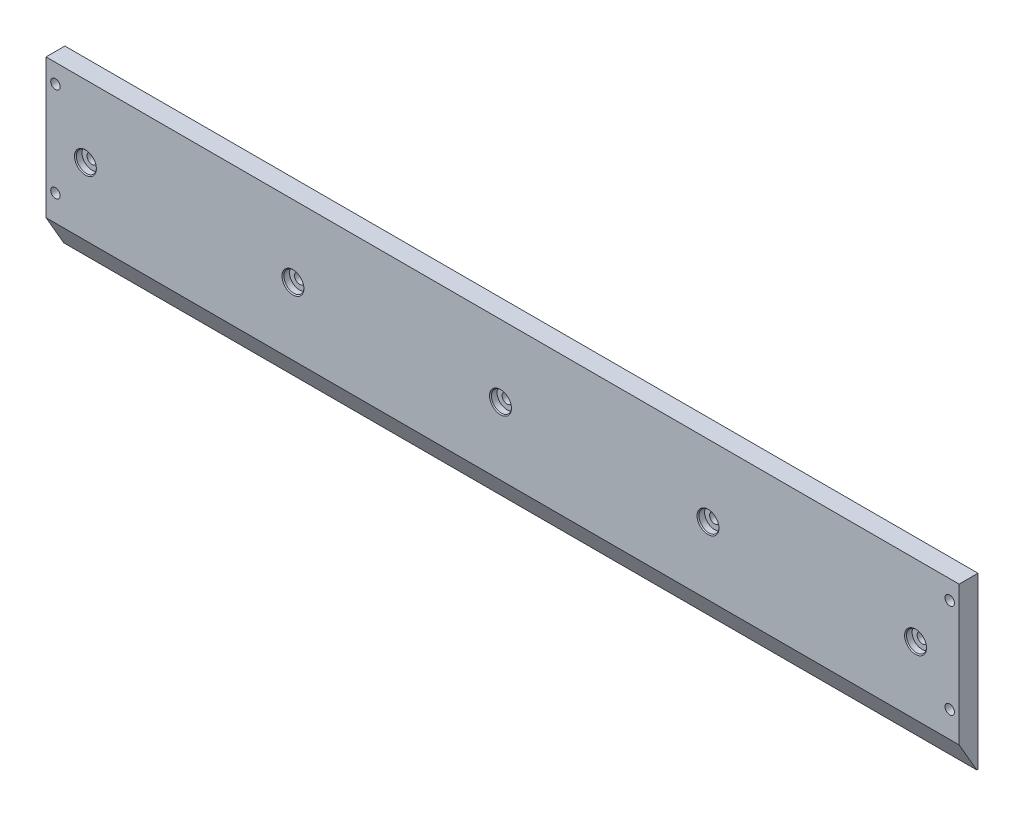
ISO-10303-21;
HEADER;
FILE_DESCRIPTION(('STEP AP214'),'2;1');
FILE_NAME('part.step','',(''),(''),'','','');
FILE_SCHEMA(('AUTOMOTIVE_DESIGN { 1 0 10303 214 1 1 1 1 }'));
ENDSEC;
DATA;
#1=APPLICATION_CONTEXT('core data for automotive mechanical design processes');
#2=APPLICATION_PROTOCOL_DEFINITION('international standard','automotive_design',2000,#1);
#3=PRODUCT_CONTEXT('',#1,'mechanical');
#4=PRODUCT('Part','Part','',(#3));
#5=PRODUCT_RELATED_PRODUCT_CATEGORY('part','',(#4));
#6=PRODUCT_DEFINITION_FORMATION('','',#4);
#7=PRODUCT_DEFINITION_CONTEXT('part definition',#1,'design');
#8=PRODUCT_DEFINITION('design','',#6,#7);
#9=PRODUCT_DEFINITION_SHAPE('','',#8);
#10=(LENGTH_UNIT() NAMED_UNIT(*) SI_UNIT(.MILLI.,.METRE.));
#11=(NAMED_UNIT(*) PLANE_ANGLE_UNIT() SI_UNIT($,.RADIAN.));
#12=(NAMED_UNIT(*) SI_UNIT($,.STERADIAN.) SOLID_ANGLE_UNIT());
#13=UNCERTAINTY_MEASURE_WITH_UNIT(LENGTH_MEASURE(1.E-05),#10,'distance_accuracy_value','');
#14=(GEOMETRIC_REPRESENTATION_CONTEXT(3) GLOBAL_UNCERTAINTY_ASSIGNED_CONTEXT((#13)) GLOBAL_UNIT_ASSIGNED_CONTEXT((#10,
#11,#12)) REPRESENTATION_CONTEXT('',''));
#15=CARTESIAN_POINT('',(0.,0.,0.));
#16=DIRECTION('',(0.,0.,1.));
#17=DIRECTION('',(1.,0.,0.));
#18=AXIS2_PLACEMENT_3D('',#15,#16,#17);
#19=CARTESIAN_POINT('',(278.003,66.04,12.7000000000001));
#20=DIRECTION('',(0.,0.,1.));
#21=DIRECTION('',(1.,0.,0.));
#22=AXIS2_PLACEMENT_3D('',#19,#20,#21);
#23=CONICAL_SURFACE('',#22,7.38124000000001,0.785398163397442);
#24=CARTESIAN_POINT('',(278.003,66.04,12.0650000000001));
#25=DIRECTION('',(0.,0.,1.));
#26=DIRECTION('',(1.,0.,0.));
#27=AXIS2_PLACEMENT_3D('',#24,#25,#26);
#28=CIRCLE('',#27,6.74624000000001);
#29=CARTESIAN_POINT('',(284.74924,66.04,12.0650000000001));
#30=VERTEX_POINT('',#29);
#31=EDGE_CURVE('E11',#30,#30,#28,.T.);
#32=ORIENTED_EDGE('',*,*,#31,.F.);
#33=EDGE_LOOP('',(#32));
#34=FACE_BOUND('',#33,.T.);
#35=CARTESIAN_POINT('',(278.003,66.04,12.7000000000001));
#36=DIRECTION('',(0.,0.,1.));
#37=DIRECTION('',(1.,0.,0.));
#38=AXIS2_PLACEMENT_3D('',#35,#36,#37);
#39=CIRCLE('',#38,7.38124000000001);
#40=CARTESIAN_POINT('',(285.38424,66.04,12.7000000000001));
#41=VERTEX_POINT('',#40);
#42=EDGE_CURVE('E156',#41,#41,#39,.T.);
#43=ORIENTED_EDGE('',*,*,#42,.T.);
#44=EDGE_LOOP('',(#43));
#45=FACE_BOUND('',#44,.T.);
#46=ADVANCED_FACE('F34',(#34,#45),#23,.F.);
#47=CARTESIAN_POINT('',(278.003,66.04,12.7000000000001));
#48=DIRECTION('',(0.,0.,1.));
#49=DIRECTION('',(1.,0.,0.));
#50=AXIS2_PLACEMENT_3D('',#47,#48,#49);
#51=CYLINDRICAL_SURFACE('',#50,6.74624000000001);
#52=CARTESIAN_POINT('',(278.003,66.04,8.25500000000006));
#53=DIRECTION('',(0.,0.,1.));
#54=DIRECTION('',(1.,0.,0.));
#55=AXIS2_PLACEMENT_3D('',#52,#53,#54);
#56=CIRCLE('',#55,6.74624000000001);
#57=CARTESIAN_POINT('',(284.74924,66.04,8.25500000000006));
#58=VERTEX_POINT('',#57);
#59=EDGE_CURVE('E42',#58,#58,#56,.T.);
#60=ORIENTED_EDGE('',*,*,#59,.F.);
#61=EDGE_LOOP('',(#60));
#62=FACE_BOUND('',#61,.T.);
#63=ORIENTED_EDGE('',*,*,#31,.T.);
#64=EDGE_LOOP('',(#63));
#65=FACE_BOUND('',#64,.T.);
#66=ADVANCED_FACE('F169',(#62,#65),#51,.F.);
#67=CARTESIAN_POINT('',(284.74924,66.04,8.25500000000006));
#68=DIRECTION('',(0.,0.,-1.));
#69=DIRECTION('',(-1.,0.,0.));
#70=AXIS2_PLACEMENT_3D('',#67,#68,#69);
#71=PLANE('',#70);
#72=CARTESIAN_POINT('',(278.003,66.04,8.25500000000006));
#73=DIRECTION('',(0.,0.,1.));
#74=DIRECTION('',(1.,0.,0.));
#75=AXIS2_PLACEMENT_3D('',#72,#73,#74);
#76=CIRCLE('',#75,3.3782);
#77=CARTESIAN_POINT('',(281.3812,66.04,8.25500000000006));
#78=VERTEX_POINT('',#77);
#79=EDGE_CURVE('E162',#78,#78,#76,.T.);
#80=ORIENTED_EDGE('',*,*,#79,.F.);
#81=EDGE_LOOP('',(#80));
#82=FACE_BOUND('',#81,.T.);
#83=ORIENTED_EDGE('',*,*,#59,.T.);
#84=EDGE_LOOP('',(#83));
#85=FACE_BOUND('',#84,.T.);
#86=ADVANCED_FACE('F167',(#82,#85),#71,.F.);
#87=CARTESIAN_POINT('',(278.003,66.04,12.7000000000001));
#88=DIRECTION('',(0.,0.,1.));
#89=DIRECTION('',(1.,0.,0.));
#90=AXIS2_PLACEMENT_3D('',#87,#88,#89);
#91=CYLINDRICAL_SURFACE('',#90,3.3782);
#92=CARTESIAN_POINT('',(278.003,66.04,0.));
#93=DIRECTION('',(0.,0.,1.));
#94=DIRECTION('',(1.,0.,0.));
#95=AXIS2_PLACEMENT_3D('',#92,#93,#94);
#96=CIRCLE('',#95,3.3782);
#97=CARTESIAN_POINT('',(281.3812,66.04,0.));
#98=VERTEX_POINT('',#97);
#99=EDGE_CURVE('E159',#98,#98,#96,.T.);
#100=ORIENTED_EDGE('',*,*,#99,.F.);
#101=EDGE_LOOP('',(#100));
#102=FACE_BOUND('',#101,.T.);
#103=ORIENTED_EDGE('',*,*,#79,.T.);
#104=EDGE_LOOP('',(#103));
#105=FACE_BOUND('',#104,.T.);
#106=ADVANCED_FACE('F228',(#102,#105),#91,.F.);
#107=CARTESIAN_POINT('',(138.303,66.04,12.7000000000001));
#108=DIRECTION('',(0.,0.,1.));
#109=DIRECTION('',(1.,0.,0.));
#110=AXIS2_PLACEMENT_3D('',#107,#108,#109);
#111=CONICAL_SURFACE('',#110,7.38124000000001,0.785398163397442);
#112=CARTESIAN_POINT('',(138.303,66.04,12.0650000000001));
#113=DIRECTION('',(0.,0.,1.));
#114=DIRECTION('',(1.,0.,0.));
#115=AXIS2_PLACEMENT_3D('',#112,#113,#114);
#116=CIRCLE('',#115,6.74624000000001);
#117=CARTESIAN_POINT('',(145.04924,66.04,12.0650000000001));
#118=VERTEX_POINT('',#117);
#119=EDGE_CURVE('E153',#118,#118,#116,.T.);
#120=ORIENTED_EDGE('',*,*,#119,.F.);
#121=EDGE_LOOP('',(#120));
#122=FACE_BOUND('',#121,.T.);
#123=CARTESIAN_POINT('',(138.303,66.04,12.7000000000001));
#124=DIRECTION('',(0.,0.,1.));
#125=DIRECTION('',(1.,0.,0.));
#126=AXIS2_PLACEMENT_3D('',#123,#124,#125);
#127=CIRCLE('',#126,7.38124000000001);
#128=CARTESIAN_POINT('',(145.68424,66.04,12.7000000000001));
#129=VERTEX_POINT('',#128);
#130=EDGE_CURVE('E141',#129,#129,#127,.T.);
#131=ORIENTED_EDGE('',*,*,#130,.T.);
#132=EDGE_LOOP('',(#131));
#133=FACE_BOUND('',#132,.T.);
#134=ADVANCED_FACE('F224',(#122,#133),#111,.F.);
#135=CARTESIAN_POINT('',(138.303,66.04,12.7000000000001));
#136=DIRECTION('',(0.,0.,1.));
#137=DIRECTION('',(1.,0.,0.));
#138=AXIS2_PLACEMENT_3D('',#135,#136,#137);
#139=CYLINDRICAL_SURFACE('',#138,6.74624000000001);
#140=CARTESIAN_POINT('',(138.303,66.04,8.25500000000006));
#141=DIRECTION('',(0.,0.,1.));
#142=DIRECTION('',(1.,0.,0.));
#143=AXIS2_PLACEMENT_3D('',#140,#141,#142);
#144=CIRCLE('',#143,6.74624000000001);
#145=CARTESIAN_POINT('',(145.04924,66.04,8.25500000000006));
#146=VERTEX_POINT('',#145);
#147=EDGE_CURVE('E150',#146,#146,#144,.T.);
#148=ORIENTED_EDGE('',*,*,#147,.F.);
#149=EDGE_LOOP('',(#148));
#150=FACE_BOUND('',#149,.T.);
#151=ORIENTED_EDGE('',*,*,#119,.T.);
#152=EDGE_LOOP('',(#151));
#153=FACE_BOUND('',#152,.T.);
#154=ADVANCED_FACE('F220',(#150,#153),#139,.F.);
#155=CARTESIAN_POINT('',(145.04924,66.04,8.25500000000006));
#156=DIRECTION('',(0.,0.,-1.));
#157=DIRECTION('',(-1.,0.,0.));
#158=AXIS2_PLACEMENT_3D('',#155,#156,#157);
#159=PLANE('',#158);
#160=CARTESIAN_POINT('',(138.303,66.04,8.25500000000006));
#161=DIRECTION('',(0.,0.,1.));
#162=DIRECTION('',(1.,0.,0.));
#163=AXIS2_PLACEMENT_3D('',#160,#161,#162);
#164=CIRCLE('',#163,3.3782);
#165=CARTESIAN_POINT('',(141.6812,66.04,8.25500000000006));
#166=VERTEX_POINT('',#165);
#167=EDGE_CURVE('E147',#166,#166,#164,.T.);
#168=ORIENTED_EDGE('',*,*,#167,.F.);
#169=EDGE_LOOP('',(#168));
#170=FACE_BOUND('',#169,.T.);
#171=ORIENTED_EDGE('',*,*,#147,.T.);
#172=EDGE_LOOP('',(#171));
#173=FACE_BOUND('',#172,.T.);
#174=ADVANCED_FACE('F216',(#170,#173),#159,.F.);
#175=CARTESIAN_POINT('',(138.303,66.04,12.7000000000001));
#176=DIRECTION('',(0.,0.,1.));
#177=DIRECTION('',(1.,0.,0.));
#178=AXIS2_PLACEMENT_3D('',#175,#176,#177);
#179=CYLINDRICAL_SURFACE('',#178,3.3782);
#180=CARTESIAN_POINT('',(138.303,66.04,0.));
#181=DIRECTION('',(0.,0.,1.));
#182=DIRECTION('',(1.,0.,0.));
#183=AXIS2_PLACEMENT_3D('',#180,#181,#182);
#184=CIRCLE('',#183,3.3782);
#185=CARTESIAN_POINT('',(141.6812,66.04,0.));
#186=VERTEX_POINT('',#185);
#187=EDGE_CURVE('E144',#186,#186,#184,.T.);
#188=ORIENTED_EDGE('',*,*,#187,.F.);
#189=EDGE_LOOP('',(#188));
#190=FACE_BOUND('',#189,.T.);
#191=ORIENTED_EDGE('',*,*,#167,.T.);
#192=EDGE_LOOP('',(#191));
#193=FACE_BOUND('',#192,.T.);
#194=ADVANCED_FACE('F212',(#190,#193),#179,.F.);
#195=CARTESIAN_POINT('',(-1.39700000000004,66.04,12.7000000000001));
#196=DIRECTION('',(0.,0.,1.));
#197=DIRECTION('',(1.,0.,0.));
#198=AXIS2_PLACEMENT_3D('',#195,#196,#197);
#199=CONICAL_SURFACE('',#198,7.38124000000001,0.785398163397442);
#200=CARTESIAN_POINT('',(-1.39700000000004,66.04,12.0650000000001));
#201=DIRECTION('',(0.,0.,1.));
#202=DIRECTION('',(1.,0.,0.));
#203=AXIS2_PLACEMENT_3D('',#200,#201,#202);
#204=CIRCLE('',#203,6.74624000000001);
#205=CARTESIAN_POINT('',(5.34923999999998,66.04,12.0650000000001));
#206=VERTEX_POINT('',#205);
#207=EDGE_CURVE('E138',#206,#206,#204,.T.);
#208=ORIENTED_EDGE('',*,*,#207,.F.);
#209=EDGE_LOOP('',(#208));
#210=FACE_BOUND('',#209,.T.);
#211=CARTESIAN_POINT('',(-1.39700000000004,66.04,12.7000000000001));
#212=DIRECTION('',(0.,0.,1.));
#213=DIRECTION('',(1.,0.,0.));
#214=AXIS2_PLACEMENT_3D('',#211,#212,#213);
#215=CIRCLE('',#214,7.38124000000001);
#216=CARTESIAN_POINT('',(5.98423999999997,66.04,12.7000000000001));
#217=VERTEX_POINT('',#216);
#218=EDGE_CURVE('E126',#217,#217,#215,.T.);
#219=ORIENTED_EDGE('',*,*,#218,.T.);
#220=EDGE_LOOP('',(#219));
#221=FACE_BOUND('',#220,.T.);
#222=ADVANCED_FACE('F208',(#210,#221),#199,.F.);
#223=CARTESIAN_POINT('',(-1.39700000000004,66.04,12.7000000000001));
#224=DIRECTION('',(0.,0.,1.));
#225=DIRECTION('',(1.,0.,0.));
#226=AXIS2_PLACEMENT_3D('',#223,#224,#225);
#227=CYLINDRICAL_SURFACE('',#226,6.74624000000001);
#228=CARTESIAN_POINT('',(-1.39700000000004,66.04,8.25500000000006));
#229=DIRECTION('',(0.,0.,1.));
#230=DIRECTION('',(1.,0.,0.));
#231=AXIS2_PLACEMENT_3D('',#228,#229,#230);
#232=CIRCLE('',#231,6.74624000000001);
#233=CARTESIAN_POINT('',(5.34923999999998,66.04,8.25500000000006));
#234=VERTEX_POINT('',#233);
#235=EDGE_CURVE('E135',#234,#234,#232,.T.);
#236=ORIENTED_EDGE('',*,*,#235,.F.);
#237=EDGE_LOOP('',(#236));
#238=FACE_BOUND('',#237,.T.);
#239=ORIENTED_EDGE('',*,*,#207,.T.);
#240=EDGE_LOOP('',(#239));
#241=FACE_BOUND('',#240,.T.);
#242=ADVANCED_FACE('F204',(#238,#241),#227,.F.);
#243=CARTESIAN_POINT('',(5.34923999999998,66.04,8.25500000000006));
#244=DIRECTION('',(0.,0.,-1.));
#245=DIRECTION('',(-1.,0.,0.));
#246=AXIS2_PLACEMENT_3D('',#243,#244,#245);
#247=PLANE('',#246);
#248=CARTESIAN_POINT('',(-1.39700000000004,66.04,8.25500000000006));
#249=DIRECTION('',(0.,0.,1.));
#250=DIRECTION('',(1.,0.,0.));
#251=AXIS2_PLACEMENT_3D('',#248,#249,#250);
#252=CIRCLE('',#251,3.3782);
#253=CARTESIAN_POINT('',(1.98119999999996,66.04,8.25500000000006));
#254=VERTEX_POINT('',#253);
#255=EDGE_CURVE('E132',#254,#254,#252,.T.);
#256=ORIENTED_EDGE('',*,*,#255,.F.);
#257=EDGE_LOOP('',(#256));
#258=FACE_BOUND('',#257,.T.);
#259=ORIENTED_EDGE('',*,*,#235,.T.);
#260=EDGE_LOOP('',(#259));
#261=FACE_BOUND('',#260,.T.);
#262=ADVANCED_FACE('F200',(#258,#261),#247,.F.);
#263=CARTESIAN_POINT('',(-1.39700000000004,66.04,12.7000000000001));
#264=DIRECTION('',(0.,0.,1.));
#265=DIRECTION('',(1.,0.,0.));
#266=AXIS2_PLACEMENT_3D('',#263,#264,#265);
#267=CYLINDRICAL_SURFACE('',#266,3.3782);
#268=CARTESIAN_POINT('',(-1.39700000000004,66.04,0.));
#269=DIRECTION('',(0.,0.,1.));
#270=DIRECTION('',(1.,0.,0.));
#271=AXIS2_PLACEMENT_3D('',#268,#269,#270);
#272=CIRCLE('',#271,3.3782);
#273=CARTESIAN_POINT('',(1.98119999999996,66.04,0.));
#274=VERTEX_POINT('',#273);
#275=EDGE_CURVE('E129',#274,#274,#272,.T.);
#276=ORIENTED_EDGE('',*,*,#275,.F.);
#277=EDGE_LOOP('',(#276));
#278=FACE_BOUND('',#277,.T.);
#279=ORIENTED_EDGE('',*,*,#255,.T.);
#280=EDGE_LOOP('',(#279));
#281=FACE_BOUND('',#280,.T.);
#282=ADVANCED_FACE('F196',(#278,#281),#267,.F.);
#283=CARTESIAN_POINT('',(307.34,114.3,0.));
#284=DIRECTION('',(0.,0.,1.));
#285=DIRECTION('',(1.,0.,0.));
#286=AXIS2_PLACEMENT_3D('',#283,#284,#285);
#287=PLANE('',#286);
#288=CARTESIAN_POINT('',(-141.097,66.04,0.));
#289=DIRECTION('',(0.,0.,1.));
#290=DIRECTION('',(1.,0.,0.));
#291=AXIS2_PLACEMENT_3D('',#288,#289,#290);
#292=CIRCLE('',#291,3.3782);
#293=CARTESIAN_POINT('',(-137.7188,66.04,0.));
#294=VERTEX_POINT('',#293);
#295=EDGE_CURVE('E481',#294,#294,#292,.T.);
#296=ORIENTED_EDGE('',*,*,#295,.T.);
#297=EDGE_LOOP('',(#296));
#298=FACE_BOUND('',#297,.T.);
#299=CARTESIAN_POINT('',(-280.797,66.04,0.));
#300=DIRECTION('',(0.,0.,1.));
#301=DIRECTION('',(1.,0.,0.));
#302=AXIS2_PLACEMENT_3D('',#299,#300,#301);
#303=CIRCLE('',#302,3.3782);
#304=CARTESIAN_POINT('',(-277.4188,66.04,0.));
#305=VERTEX_POINT('',#304);
#306=EDGE_CURVE('E505',#305,#305,#303,.T.);
#307=ORIENTED_EDGE('',*,*,#306,.T.);
#308=EDGE_LOOP('',(#307));
#309=FACE_BOUND('',#308,.T.);
#310=CARTESIAN_POINT('',(-300.99,38.1,0.));
#311=DIRECTION('',(0.,0.,1.));
#312=DIRECTION('',(1.,0.,0.));
#313=AXIS2_PLACEMENT_3D('',#310,#311,#312);
#314=CIRCLE('',#313,3.17499999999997);
#315=CARTESIAN_POINT('',(-297.815,38.1,0.));
#316=VERTEX_POINT('',#315);
#317=EDGE_CURVE('E523',#316,#316,#314,.T.);
#318=ORIENTED_EDGE('',*,*,#317,.T.);
#319=EDGE_LOOP('',(#318));
#320=FACE_BOUND('',#319,.T.);
#321=CARTESIAN_POINT('',(300.99,38.1,0.));
#322=DIRECTION('',(0.,0.,1.));
#323=DIRECTION('',(1.,0.,0.));
#324=AXIS2_PLACEMENT_3D('',#321,#322,#323);
#325=CIRCLE('',#324,3.17499999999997);
#326=CARTESIAN_POINT('',(304.165,38.1,0.));
#327=VERTEX_POINT('',#326);
#328=EDGE_CURVE('E520',#327,#327,#325,.T.);
#329=ORIENTED_EDGE('',*,*,#328,.T.);
#330=EDGE_LOOP('',(#329));
#331=FACE_BOUND('',#330,.T.);
#332=CARTESIAN_POINT('',(300.99,101.6,0.));
#333=DIRECTION('',(0.,0.,1.));
#334=DIRECTION('',(1.,0.,0.));
#335=AXIS2_PLACEMENT_3D('',#332,#333,#334);
#336=CIRCLE('',#335,3.17499999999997);
#337=CARTESIAN_POINT('',(304.165,101.6,0.));
#338=VERTEX_POINT('',#337);
#339=EDGE_CURVE('E512',#338,#338,#336,.T.);
#340=ORIENTED_EDGE('',*,*,#339,.T.);
#341=EDGE_LOOP('',(#340));
#342=FACE_BOUND('',#341,.T.);
#343=CARTESIAN_POINT('',(-300.99,101.6,0.));
#344=DIRECTION('',(0.,0.,1.));
#345=DIRECTION('',(1.,0.,0.));
#346=AXIS2_PLACEMENT_3D('',#343,#344,#345);
#347=CIRCLE('',#346,3.17499999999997);
#348=CARTESIAN_POINT('',(-297.815,101.6,0.));
#349=VERTEX_POINT('',#348);
#350=EDGE_CURVE('E115',#349,#349,#347,.T.);
#351=ORIENTED_EDGE('',*,*,#350,.T.);
#352=EDGE_LOOP('',(#351));
#353=FACE_BOUND('',#352,.T.);
#354=DIRECTION('',(0.,1.,0.));
#355=VECTOR('',#354,1.);
#356=CARTESIAN_POINT('',(-307.34,114.3,0.));
#357=LINE('',#356,#355);
#358=CARTESIAN_POINT('',(-307.34,0.,0.));
#359=VERTEX_POINT('',#358);
#360=CARTESIAN_POINT('',(-307.34,114.3,0.));
#361=VERTEX_POINT('',#360);
#362=EDGE_CURVE('E111',#359,#361,#357,.T.);
#363=ORIENTED_EDGE('',*,*,#362,.T.);
#364=DIRECTION('',(-1.,0.,0.));
#365=VECTOR('',#364,1.);
#366=CARTESIAN_POINT('',(307.34,114.3,0.));
#367=LINE('',#366,#365);
#368=CARTESIAN_POINT('',(307.34,114.3,0.));
#369=VERTEX_POINT('',#368);
#370=EDGE_CURVE('E124',#369,#361,#367,.T.);
#371=ORIENTED_EDGE('',*,*,#370,.F.);
#372=DIRECTION('',(0.,1.,0.));
#373=VECTOR('',#372,1.);
#374=CARTESIAN_POINT('',(307.34,114.3,0.));
#375=LINE('',#374,#373);
#376=CARTESIAN_POINT('',(307.34,0.,0.));
#377=VERTEX_POINT('',#376);
#378=EDGE_CURVE('E120',#377,#369,#375,.T.);
#379=ORIENTED_EDGE('',*,*,#378,.F.);
#380=DIRECTION('',(-1.,0.,0.));
#381=VECTOR('',#380,1.);
#382=CARTESIAN_POINT('',(307.34,0.,0.));
#383=LINE('',#382,#381);
#384=EDGE_CURVE('E107',#377,#359,#383,.T.);
#385=ORIENTED_EDGE('',*,*,#384,.T.);
#386=EDGE_LOOP('',(#363,#371,#379,#385));
#387=FACE_BOUND('',#386,.T.);
#388=ORIENTED_EDGE('',*,*,#275,.T.);
#389=EDGE_LOOP('',(#388));
#390=FACE_BOUND('',#389,.T.);
#391=ORIENTED_EDGE('',*,*,#187,.T.);
#392=EDGE_LOOP('',(#391));
#393=FACE_BOUND('',#392,.T.);
#394=ORIENTED_EDGE('',*,*,#99,.T.);
#395=EDGE_LOOP('',(#394));
#396=FACE_BOUND('',#395,.T.);
#397=ADVANCED_FACE('F188',(#298,#309,#320,#331,#342,#353,#387,#390,#393,#396),#287,.F.);
#398=CARTESIAN_POINT('',(307.34,114.3,12.7));
#399=DIRECTION('',(0.,-1.,0.));
#400=DIRECTION('',(0.,0.,-1.));
#401=AXIS2_PLACEMENT_3D('',#398,#399,#400);
#402=PLANE('',#401);
#403=DIRECTION('',(0.,0.,1.));
#404=VECTOR('',#403,1.);
#405=CARTESIAN_POINT('',(-307.34,114.3,12.7));
#406=LINE('',#405,#404);
#407=CARTESIAN_POINT('',(-307.34,114.3,12.7));
#408=VERTEX_POINT('',#407);
#409=EDGE_CURVE('E114',#361,#408,#406,.T.);
#410=ORIENTED_EDGE('',*,*,#409,.T.);
#411=DIRECTION('',(-1.,0.,0.));
#412=VECTOR('',#411,1.);
#413=CARTESIAN_POINT('',(307.34,114.3,12.7));
#414=LINE('',#413,#412);
#415=CARTESIAN_POINT('',(307.34,114.3,12.7));
#416=VERTEX_POINT('',#415);
#417=EDGE_CURVE('E102',#416,#408,#414,.T.);
#418=ORIENTED_EDGE('',*,*,#417,.F.);
#419=DIRECTION('',(0.,0.,1.));
#420=VECTOR('',#419,1.);
#421=CARTESIAN_POINT('',(307.34,114.3,12.7));
#422=LINE('',#421,#420);
#423=EDGE_CURVE('E85',#369,#416,#422,.T.);
#424=ORIENTED_EDGE('',*,*,#423,.F.);
#425=ORIENTED_EDGE('',*,*,#370,.T.);
#426=EDGE_LOOP('',(#410,#418,#424,#425));
#427=FACE_BOUND('',#426,.T.);
#428=ADVANCED_FACE('F179',(#427),#402,.F.);
#429=CARTESIAN_POINT('',(307.34,20.574,12.7));
#430=DIRECTION('',(0.,0.,-1.));
#431=DIRECTION('',(0.,1.,0.));
#432=AXIS2_PLACEMENT_3D('',#429,#430,#431);
#433=PLANE('',#432);
#434=CARTESIAN_POINT('',(-141.097,66.04,12.7000000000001));
#435=DIRECTION('',(0.,0.,1.));
#436=DIRECTION('',(1.,0.,0.));
#437=AXIS2_PLACEMENT_3D('',#434,#435,#436);
#438=CIRCLE('',#437,7.38124000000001);
#439=CARTESIAN_POINT('',(-133.71576,66.04,12.7000000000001));
#440=VERTEX_POINT('',#439);
#441=EDGE_CURVE('E480',#440,#440,#438,.T.);
#442=ORIENTED_EDGE('',*,*,#441,.F.);
#443=EDGE_LOOP('',(#442));
#444=FACE_BOUND('',#443,.T.);
#445=CARTESIAN_POINT('',(-280.797,66.04,12.7000000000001));
#446=DIRECTION('',(0.,0.,1.));
#447=DIRECTION('',(1.,0.,0.));
#448=AXIS2_PLACEMENT_3D('',#445,#446,#447);
#449=CIRCLE('',#448,7.38124000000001);
#450=CARTESIAN_POINT('',(-273.41576,66.04,12.7000000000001));
#451=VERTEX_POINT('',#450);
#452=EDGE_CURVE('E493',#451,#451,#449,.T.);
#453=ORIENTED_EDGE('',*,*,#452,.F.);
#454=EDGE_LOOP('',(#453));
#455=FACE_BOUND('',#454,.T.);
#456=CARTESIAN_POINT('',(-300.99,38.1,12.7000000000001));
#457=DIRECTION('',(0.,0.,1.));
#458=DIRECTION('',(1.,0.,0.));
#459=AXIS2_PLACEMENT_3D('',#456,#457,#458);
#460=CIRCLE('',#459,3.17499999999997);
#461=CARTESIAN_POINT('',(-297.815,38.1,12.7000000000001));
#462=VERTEX_POINT('',#461);
#463=EDGE_CURVE('E509',#462,#462,#460,.T.);
#464=ORIENTED_EDGE('',*,*,#463,.F.);
#465=EDGE_LOOP('',(#464));
#466=FACE_BOUND('',#465,.T.);
#467=CARTESIAN_POINT('',(300.99,38.1,12.7000000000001));
#468=DIRECTION('',(0.,0.,1.));
#469=DIRECTION('',(-1.,0.,0.));
#470=AXIS2_PLACEMENT_3D('',#467,#468,#469);
#471=CIRCLE('',#470,3.17499999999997);
#472=CARTESIAN_POINT('',(297.815,38.1,12.7000000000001));
#473=VERTEX_POINT('',#472);
#474=EDGE_CURVE('E513',#473,#473,#471,.T.);
#475=ORIENTED_EDGE('',*,*,#474,.F.);
#476=EDGE_LOOP('',(#475));
#477=FACE_BOUND('',#476,.T.);
#478=CARTESIAN_POINT('',(300.99,101.6,12.7000000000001));
#479=DIRECTION('',(0.,0.,1.));
#480=DIRECTION('',(-1.,0.,0.));
#481=AXIS2_PLACEMENT_3D('',#478,#479,#480);
#482=CIRCLE('',#481,3.17499999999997);
#483=CARTESIAN_POINT('',(297.815,101.6,12.7000000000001));
#484=VERTEX_POINT('',#483);
#485=EDGE_CURVE('E508',#484,#484,#482,.T.);
#486=ORIENTED_EDGE('',*,*,#485,.F.);
#487=EDGE_LOOP('',(#486));
#488=FACE_BOUND('',#487,.T.);
#489=CARTESIAN_POINT('',(-300.99,101.6,12.7000000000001));
#490=DIRECTION('',(0.,0.,1.));
#491=DIRECTION('',(1.,0.,0.));
#492=AXIS2_PLACEMENT_3D('',#489,#490,#491);
#493=CIRCLE('',#492,3.17499999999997);
#494=CARTESIAN_POINT('',(-297.815,101.6,12.7000000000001));
#495=VERTEX_POINT('',#494);
#496=EDGE_CURVE('E526',#495,#495,#493,.T.);
#497=ORIENTED_EDGE('',*,*,#496,.F.);
#498=EDGE_LOOP('',(#497));
#499=FACE_BOUND('',#498,.T.);
#500=DIRECTION('',(0.,-1.,0.));
#501=VECTOR('',#500,1.);
#502=CARTESIAN_POINT('',(-307.34,20.574,12.7));
#503=LINE('',#502,#501);
#504=CARTESIAN_POINT('',(-307.34,20.574,12.7));
#505=VERTEX_POINT('',#504);
#506=EDGE_CURVE('E101',#408,#505,#503,.T.);
#507=ORIENTED_EDGE('',*,*,#506,.T.);
#508=DIRECTION('',(-1.,0.,0.));
#509=VECTOR('',#508,1.);
#510=CARTESIAN_POINT('',(307.34,20.574,12.7));
#511=LINE('',#510,#509);
#512=CARTESIAN_POINT('',(307.34,20.574,12.7));
#513=VERTEX_POINT('',#512);
#514=EDGE_CURVE('E97',#513,#505,#511,.T.);
#515=ORIENTED_EDGE('',*,*,#514,.F.);
#516=DIRECTION('',(0.,-1.,0.));
#517=VECTOR('',#516,1.);
#518=CARTESIAN_POINT('',(307.34,20.574,12.7));
#519=LINE('',#518,#517);
#520=EDGE_CURVE('E89',#416,#513,#519,.T.);
#521=ORIENTED_EDGE('',*,*,#520,.F.);
#522=ORIENTED_EDGE('',*,*,#417,.T.);
#523=EDGE_LOOP('',(#507,#515,#521,#522));
#524=FACE_BOUND('',#523,.T.);
#525=ORIENTED_EDGE('',*,*,#218,.F.);
#526=EDGE_LOOP('',(#525));
#527=FACE_BOUND('',#526,.T.);
#528=ORIENTED_EDGE('',*,*,#130,.F.);
#529=EDGE_LOOP('',(#528));
#530=FACE_BOUND('',#529,.T.);
#531=ORIENTED_EDGE('',*,*,#42,.F.);
#532=EDGE_LOOP('',(#531));
#533=FACE_BOUND('',#532,.T.);
#534=ADVANCED_FACE('F98',(#444,#455,#466,#477,#488,#499,#524,#527,#530,#533),#433,.F.);
#535=CARTESIAN_POINT('',(307.34,0.,0.821595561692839));
#536=DIRECTION('',(0.,0.499999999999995,-0.866025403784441));
#537=DIRECTION('',(0.,0.866025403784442,0.499999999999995));
#538=AXIS2_PLACEMENT_3D('',#535,#536,#537);
#539=PLANE('',#538);
#540=DIRECTION('',(0.,-0.866025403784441,-0.499999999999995));
#541=VECTOR('',#540,1.);
#542=CARTESIAN_POINT('',(-307.34,0.,0.821595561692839));
#543=LINE('',#542,#541);
#544=CARTESIAN_POINT('',(-307.34,0.,0.821595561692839));
#545=VERTEX_POINT('',#544);
#546=EDGE_CURVE('E70',#505,#545,#543,.T.);
#547=ORIENTED_EDGE('',*,*,#546,.T.);
#548=DIRECTION('',(-1.,0.,0.));
#549=VECTOR('',#548,1.);
#550=CARTESIAN_POINT('',(307.34,0.,0.821595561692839));
#551=LINE('',#550,#549);
#552=CARTESIAN_POINT('',(307.34,0.,0.821595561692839));
#553=VERTEX_POINT('',#552);
#554=EDGE_CURVE('E103',#553,#545,#551,.T.);
#555=ORIENTED_EDGE('',*,*,#554,.F.);
#556=DIRECTION('',(0.,-0.866025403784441,-0.499999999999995));
#557=VECTOR('',#556,1.);
#558=CARTESIAN_POINT('',(307.34,0.,0.821595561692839));
#559=LINE('',#558,#557);
#560=EDGE_CURVE('E93',#513,#553,#559,.T.);
#561=ORIENTED_EDGE('',*,*,#560,.F.);
#562=ORIENTED_EDGE('',*,*,#514,.T.);
#563=EDGE_LOOP('',(#547,#555,#561,#562));
#564=FACE_BOUND('',#563,.T.);
#565=ADVANCED_FACE('F105',(#564),#539,.F.);
#566=CARTESIAN_POINT('',(307.34,0.,0.));
#567=DIRECTION('',(0.,1.,0.));
#568=DIRECTION('',(0.,0.,1.));
#569=AXIS2_PLACEMENT_3D('',#566,#567,#568);
#570=PLANE('',#569);
#571=DIRECTION('',(0.,0.,-1.));
#572=VECTOR('',#571,1.);
#573=CARTESIAN_POINT('',(-307.34,0.,0.));
#574=LINE('',#573,#572);
#575=EDGE_CURVE('E76',#545,#359,#574,.T.);
#576=ORIENTED_EDGE('',*,*,#575,.T.);
#577=ORIENTED_EDGE('',*,*,#384,.F.);
#578=DIRECTION('',(0.,0.,-1.));
#579=VECTOR('',#578,1.);
#580=CARTESIAN_POINT('',(307.34,0.,0.));
#581=LINE('',#580,#579);
#582=EDGE_CURVE('E50',#553,#377,#581,.T.);
#583=ORIENTED_EDGE('',*,*,#582,.F.);
#584=ORIENTED_EDGE('',*,*,#554,.T.);
#585=EDGE_LOOP('',(#576,#577,#583,#584));
#586=FACE_BOUND('',#585,.T.);
#587=ADVANCED_FACE('F186',(#586),#570,.F.);
#588=CARTESIAN_POINT('',(307.34,0.,0.));
#589=DIRECTION('',(-1.,0.,0.));
#590=DIRECTION('',(0.,0.,1.));
#591=AXIS2_PLACEMENT_3D('',#588,#589,#590);
#592=PLANE('',#591);
#593=ORIENTED_EDGE('',*,*,#378,.T.);
#594=ORIENTED_EDGE('',*,*,#423,.T.);
#595=ORIENTED_EDGE('',*,*,#520,.T.);
#596=ORIENTED_EDGE('',*,*,#560,.T.);
#597=ORIENTED_EDGE('',*,*,#582,.T.);
#598=EDGE_LOOP('',(#593,#594,#595,#596,#597));
#599=FACE_BOUND('',#598,.T.);
#600=ADVANCED_FACE('F91',(#599),#592,.F.);
#601=CARTESIAN_POINT('',(-307.34,0.,0.));
#602=DIRECTION('',(-1.,0.,0.));
#603=DIRECTION('',(0.,0.,1.));
#604=AXIS2_PLACEMENT_3D('',#601,#602,#603);
#605=PLANE('',#604);
#606=ORIENTED_EDGE('',*,*,#362,.F.);
#607=ORIENTED_EDGE('',*,*,#575,.F.);
#608=ORIENTED_EDGE('',*,*,#546,.F.);
#609=ORIENTED_EDGE('',*,*,#506,.F.);
#610=ORIENTED_EDGE('',*,*,#409,.F.);
#611=EDGE_LOOP('',(#606,#607,#608,#609,#610));
#612=FACE_BOUND('',#611,.T.);
#613=ADVANCED_FACE('F308',(#612),#605,.T.);
#614=CARTESIAN_POINT('',(-300.99,101.6,-74.9299999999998));
#615=DIRECTION('',(0.,0.,1.));
#616=DIRECTION('',(1.,0.,0.));
#617=AXIS2_PLACEMENT_3D('',#614,#615,#616);
#618=CYLINDRICAL_SURFACE('',#617,3.17499999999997);
#619=ORIENTED_EDGE('',*,*,#496,.T.);
#620=EDGE_LOOP('',(#619));
#621=FACE_BOUND('',#620,.T.);
#622=ORIENTED_EDGE('',*,*,#350,.F.);
#623=EDGE_LOOP('',(#622));
#624=FACE_BOUND('',#623,.T.);
#625=ADVANCED_FACE('F317',(#621,#624),#618,.F.);
#626=CARTESIAN_POINT('',(300.99,101.6,-74.9299999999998));
#627=DIRECTION('',(0.,0.,1.));
#628=DIRECTION('',(1.,0.,0.));
#629=AXIS2_PLACEMENT_3D('',#626,#627,#628);
#630=CYLINDRICAL_SURFACE('',#629,3.17499999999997);
#631=ORIENTED_EDGE('',*,*,#485,.T.);
#632=EDGE_LOOP('',(#631));
#633=FACE_BOUND('',#632,.T.);
#634=ORIENTED_EDGE('',*,*,#339,.F.);
#635=EDGE_LOOP('',(#634));
#636=FACE_BOUND('',#635,.T.);
#637=ADVANCED_FACE('F328',(#633,#636),#630,.F.);
#638=CARTESIAN_POINT('',(300.99,38.1,-74.9299999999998));
#639=DIRECTION('',(0.,0.,1.));
#640=DIRECTION('',(1.,0.,0.));
#641=AXIS2_PLACEMENT_3D('',#638,#639,#640);
#642=CYLINDRICAL_SURFACE('',#641,3.17499999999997);
#643=ORIENTED_EDGE('',*,*,#474,.T.);
#644=EDGE_LOOP('',(#643));
#645=FACE_BOUND('',#644,.T.);
#646=ORIENTED_EDGE('',*,*,#328,.F.);
#647=EDGE_LOOP('',(#646));
#648=FACE_BOUND('',#647,.T.);
#649=ADVANCED_FACE('F340',(#645,#648),#642,.F.);
#650=CARTESIAN_POINT('',(-300.99,38.1,-74.9299999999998));
#651=DIRECTION('',(0.,0.,1.));
#652=DIRECTION('',(1.,0.,0.));
#653=AXIS2_PLACEMENT_3D('',#650,#651,#652);
#654=CYLINDRICAL_SURFACE('',#653,3.17499999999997);
#655=ORIENTED_EDGE('',*,*,#463,.T.);
#656=EDGE_LOOP('',(#655));
#657=FACE_BOUND('',#656,.T.);
#658=ORIENTED_EDGE('',*,*,#317,.F.);
#659=EDGE_LOOP('',(#658));
#660=FACE_BOUND('',#659,.T.);
#661=ADVANCED_FACE('F351',(#657,#660),#654,.F.);
#662=CARTESIAN_POINT('',(-280.797,66.04,12.7000000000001));
#663=DIRECTION('',(0.,0.,1.));
#664=DIRECTION('',(1.,0.,0.));
#665=AXIS2_PLACEMENT_3D('',#662,#663,#664);
#666=CYLINDRICAL_SURFACE('',#665,3.3782);
#667=ORIENTED_EDGE('',*,*,#306,.F.);
#668=EDGE_LOOP('',(#667));
#669=FACE_BOUND('',#668,.T.);
#670=CARTESIAN_POINT('',(-280.797,66.04,8.25500000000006));
#671=DIRECTION('',(0.,0.,1.));
#672=DIRECTION('',(1.,0.,0.));
#673=AXIS2_PLACEMENT_3D('',#670,#671,#672);
#674=CIRCLE('',#673,3.3782);
#675=CARTESIAN_POINT('',(-277.4188,66.04,8.25500000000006));
#676=VERTEX_POINT('',#675);
#677=EDGE_CURVE('E502',#676,#676,#674,.T.);
#678=ORIENTED_EDGE('',*,*,#677,.T.);
#679=EDGE_LOOP('',(#678));
#680=FACE_BOUND('',#679,.T.);
#681=ADVANCED_FACE('F361',(#669,#680),#666,.F.);
#682=CARTESIAN_POINT('',(-274.05076,66.04,8.25500000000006));
#683=DIRECTION('',(0.,0.,-1.));
#684=DIRECTION('',(-1.,0.,0.));
#685=AXIS2_PLACEMENT_3D('',#682,#683,#684);
#686=PLANE('',#685);
#687=ORIENTED_EDGE('',*,*,#677,.F.);
#688=EDGE_LOOP('',(#687));
#689=FACE_BOUND('',#688,.T.);
#690=CARTESIAN_POINT('',(-280.797,66.04,8.25500000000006));
#691=DIRECTION('',(0.,0.,1.));
#692=DIRECTION('',(1.,0.,0.));
#693=AXIS2_PLACEMENT_3D('',#690,#691,#692);
#694=CIRCLE('',#693,6.74624000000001);
#695=CARTESIAN_POINT('',(-274.05076,66.04,8.25500000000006));
#696=VERTEX_POINT('',#695);
#697=EDGE_CURVE('E499',#696,#696,#694,.T.);
#698=ORIENTED_EDGE('',*,*,#697,.T.);
#699=EDGE_LOOP('',(#698));
#700=FACE_BOUND('',#699,.T.);
#701=ADVANCED_FACE('F371',(#689,#700),#686,.F.);
#702=CARTESIAN_POINT('',(-280.797,66.04,12.7000000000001));
#703=DIRECTION('',(0.,0.,1.));
#704=DIRECTION('',(1.,0.,0.));
#705=AXIS2_PLACEMENT_3D('',#702,#703,#704);
#706=CYLINDRICAL_SURFACE('',#705,6.74624000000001);
#707=ORIENTED_EDGE('',*,*,#697,.F.);
#708=EDGE_LOOP('',(#707));
#709=FACE_BOUND('',#708,.T.);
#710=CARTESIAN_POINT('',(-280.797,66.04,12.0650000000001));
#711=DIRECTION('',(0.,0.,1.));
#712=DIRECTION('',(1.,0.,0.));
#713=AXIS2_PLACEMENT_3D('',#710,#711,#712);
#714=CIRCLE('',#713,6.74624000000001);
#715=CARTESIAN_POINT('',(-274.05076,66.04,12.0650000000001));
#716=VERTEX_POINT('',#715);
#717=EDGE_CURVE('E496',#716,#716,#714,.T.);
#718=ORIENTED_EDGE('',*,*,#717,.T.);
#719=EDGE_LOOP('',(#718));
#720=FACE_BOUND('',#719,.T.);
#721=ADVANCED_FACE('F381',(#709,#720),#706,.F.);
#722=CARTESIAN_POINT('',(-280.797,66.04,12.7000000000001));
#723=DIRECTION('',(0.,0.,1.));
#724=DIRECTION('',(1.,0.,0.));
#725=AXIS2_PLACEMENT_3D('',#722,#723,#724);
#726=CONICAL_SURFACE('',#725,7.38124000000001,0.785398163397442);
#727=ORIENTED_EDGE('',*,*,#717,.F.);
#728=EDGE_LOOP('',(#727));
#729=FACE_BOUND('',#728,.T.);
#730=ORIENTED_EDGE('',*,*,#452,.T.);
#731=EDGE_LOOP('',(#730));
#732=FACE_BOUND('',#731,.T.);
#733=ADVANCED_FACE('F391',(#729,#732),#726,.F.);
#734=CARTESIAN_POINT('',(-141.097,66.04,12.7000000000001));
#735=DIRECTION('',(0.,0.,1.));
#736=DIRECTION('',(1.,0.,0.));
#737=AXIS2_PLACEMENT_3D('',#734,#735,#736);
#738=CYLINDRICAL_SURFACE('',#737,3.3782);
#739=ORIENTED_EDGE('',*,*,#295,.F.);
#740=EDGE_LOOP('',(#739));
#741=FACE_BOUND('',#740,.T.);
#742=CARTESIAN_POINT('',(-141.097,66.04,8.25500000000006));
#743=DIRECTION('',(0.,0.,1.));
#744=DIRECTION('',(1.,0.,0.));
#745=AXIS2_PLACEMENT_3D('',#742,#743,#744);
#746=CIRCLE('',#745,3.3782);
#747=CARTESIAN_POINT('',(-137.7188,66.04,8.25500000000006));
#748=VERTEX_POINT('',#747);
#749=EDGE_CURVE('E490',#748,#748,#746,.T.);
#750=ORIENTED_EDGE('',*,*,#749,.T.);
#751=EDGE_LOOP('',(#750));
#752=FACE_BOUND('',#751,.T.);
#753=ADVANCED_FACE('F401',(#741,#752),#738,.F.);
#754=CARTESIAN_POINT('',(-134.35076,66.04,8.25500000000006));
#755=DIRECTION('',(0.,0.,-1.));
#756=DIRECTION('',(-1.,0.,0.));
#757=AXIS2_PLACEMENT_3D('',#754,#755,#756);
#758=PLANE('',#757);
#759=ORIENTED_EDGE('',*,*,#749,.F.);
#760=EDGE_LOOP('',(#759));
#761=FACE_BOUND('',#760,.T.);
#762=CARTESIAN_POINT('',(-141.097,66.04,8.25500000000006));
#763=DIRECTION('',(0.,0.,1.));
#764=DIRECTION('',(1.,0.,0.));
#765=AXIS2_PLACEMENT_3D('',#762,#763,#764);
#766=CIRCLE('',#765,6.74624000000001);
#767=CARTESIAN_POINT('',(-134.35076,66.04,8.25500000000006));
#768=VERTEX_POINT('',#767);
#769=EDGE_CURVE('E487',#768,#768,#766,.T.);
#770=ORIENTED_EDGE('',*,*,#769,.T.);
#771=EDGE_LOOP('',(#770));
#772=FACE_BOUND('',#771,.T.);
#773=ADVANCED_FACE('F442',(#761,#772),#758,.F.);
#774=CARTESIAN_POINT('',(-141.097,66.04,12.7000000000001));
#775=DIRECTION('',(0.,0.,1.));
#776=DIRECTION('',(1.,0.,0.));
#777=AXIS2_PLACEMENT_3D('',#774,#775,#776);
#778=CYLINDRICAL_SURFACE('',#777,6.74624000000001);
#779=ORIENTED_EDGE('',*,*,#769,.F.);
#780=EDGE_LOOP('',(#779));
#781=FACE_BOUND('',#780,.T.);
#782=CARTESIAN_POINT('',(-141.097,66.04,12.0650000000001));
#783=DIRECTION('',(0.,0.,1.));
#784=DIRECTION('',(1.,0.,0.));
#785=AXIS2_PLACEMENT_3D('',#782,#783,#784);
#786=CIRCLE('',#785,6.74624000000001);
#787=CARTESIAN_POINT('',(-134.35076,66.04,12.0650000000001));
#788=VERTEX_POINT('',#787);
#789=EDGE_CURVE('E478',#788,#788,#786,.T.);
#790=ORIENTED_EDGE('',*,*,#789,.T.);
#791=EDGE_LOOP('',(#790));
#792=FACE_BOUND('',#791,.T.);
#793=ADVANCED_FACE('F451',(#781,#792),#778,.F.);
#794=CARTESIAN_POINT('',(-141.097,66.04,12.7000000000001));
#795=DIRECTION('',(0.,0.,1.));
#796=DIRECTION('',(1.,0.,0.));
#797=AXIS2_PLACEMENT_3D('',#794,#795,#796);
#798=CONICAL_SURFACE('',#797,7.38124000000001,0.785398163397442);
#799=ORIENTED_EDGE('',*,*,#789,.F.);
#800=EDGE_LOOP('',(#799));
#801=FACE_BOUND('',#800,.T.);
#802=ORIENTED_EDGE('',*,*,#441,.T.);
#803=EDGE_LOOP('',(#802));
#804=FACE_BOUND('',#803,.T.);
#805=ADVANCED_FACE('F460',(#801,#804),#798,.F.);
#806=CLOSED_SHELL('',(#46,#66,#86,#106,#134,#154,#174,#194,#222,#242,#262,#282,#397,#428,#534,
#565,#587,#600,#613,#625,#637,#649,#661,#681,#701,#721,#733,#753,#773,#793,#805));
#807=MANIFOLD_SOLID_BREP('B2',#806);
#808=ADVANCED_BREP_SHAPE_REPRESENTATION('',(#18,#807),#14);
#809=SHAPE_DEFINITION_REPRESENTATION(#9,#808);
ENDSEC;
END-ISO-10303-21;
